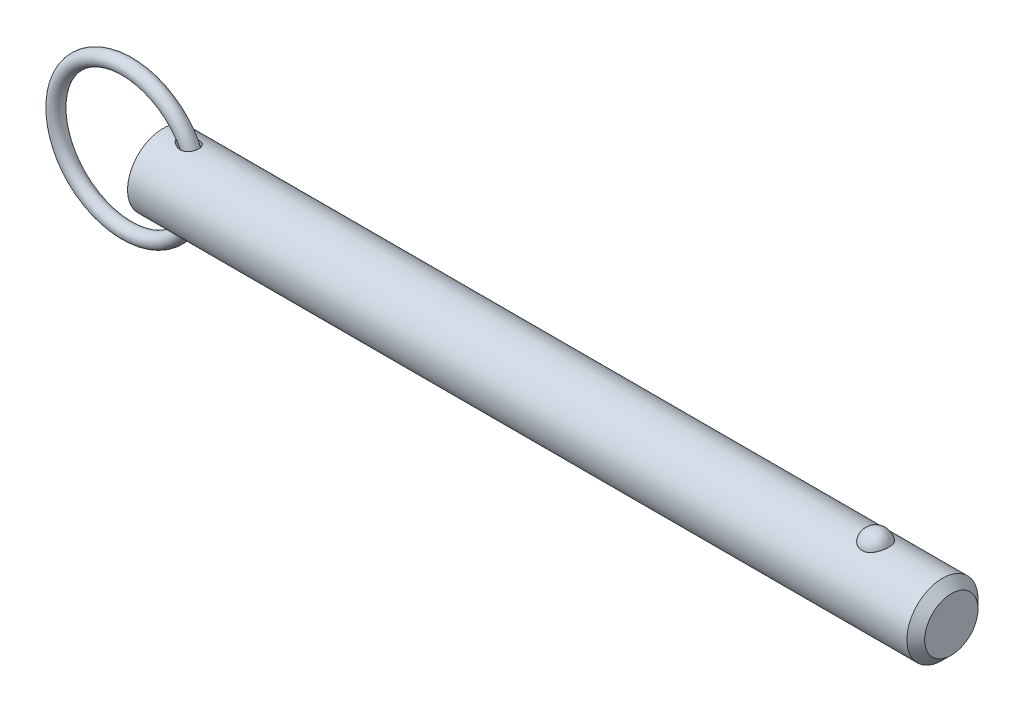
ISO-10303-21;
HEADER;
FILE_DESCRIPTION(('STEP AP214'),'2;1');
FILE_NAME('part.step','',(''),(''),'','','');
FILE_SCHEMA(('AUTOMOTIVE_DESIGN { 1 0 10303 214 1 1 1 1 }'));
ENDSEC;
DATA;
#1=APPLICATION_CONTEXT('core data for automotive mechanical design processes');
#2=APPLICATION_PROTOCOL_DEFINITION('international standard','automotive_design',2000,#1);
#3=PRODUCT_CONTEXT('',#1,'mechanical');
#4=PRODUCT('Part','Part','',(#3));
#5=PRODUCT_RELATED_PRODUCT_CATEGORY('part','',(#4));
#6=PRODUCT_DEFINITION_FORMATION('','',#4);
#7=PRODUCT_DEFINITION_CONTEXT('part definition',#1,'design');
#8=PRODUCT_DEFINITION('design','',#6,#7);
#9=PRODUCT_DEFINITION_SHAPE('','',#8);
#10=(LENGTH_UNIT() NAMED_UNIT(*) SI_UNIT(.MILLI.,.METRE.));
#11=(NAMED_UNIT(*) PLANE_ANGLE_UNIT() SI_UNIT($,.RADIAN.));
#12=(NAMED_UNIT(*) SI_UNIT($,.STERADIAN.) SOLID_ANGLE_UNIT());
#13=UNCERTAINTY_MEASURE_WITH_UNIT(LENGTH_MEASURE(1.E-05),#10,'distance_accuracy_value','');
#14=(GEOMETRIC_REPRESENTATION_CONTEXT(3) GLOBAL_UNCERTAINTY_ASSIGNED_CONTEXT((#13)) GLOBAL_UNIT_ASSIGNED_CONTEXT((#10,
#11,#12)) REPRESENTATION_CONTEXT('',''));
#15=CARTESIAN_POINT('',(0.,0.,0.));
#16=DIRECTION('',(0.,0.,1.));
#17=DIRECTION('',(1.,0.,0.));
#18=AXIS2_PLACEMENT_3D('',#15,#16,#17);
#19=CARTESIAN_POINT('',(-9.66825126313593,0.,0.));
#20=DIRECTION('',(0.,0.,1.));
#21=DIRECTION('',(1.,0.,0.));
#22=AXIS2_PLACEMENT_3D('',#19,#20,#21);
#23=TOROIDAL_SURFACE('',#22,19.05,1.905);
#24=CARTESIAN_POINT('',(11.2867487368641,0.,0.));
#25=VERTEX_POINT('',#24);
#26=VERTEX_LOOP('',#25);
#27=FACE_BOUND('',#26,.T.);
#28=ADVANCED_FACE('P0_F12',(#27),#23,.T.);
#29=CLOSED_SHELL('',(#28));
#30=MANIFOLD_SOLID_BREP('P0_B1',#29);
#31=CARTESIAN_POINT('',(0.,0.,0.));
#32=DIRECTION('',(1.,0.,0.));
#33=DIRECTION('',(0.,0.,-1.));
#34=AXIS2_PLACEMENT_3D('',#31,#32,#33);
#35=CYLINDRICAL_SURFACE('',#34,9.525);
#36=CARTESIAN_POINT('',(4.56693409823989,9.43141941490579,-1.33189820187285));
#37=CARTESIAN_POINT('',(4.70260475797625,9.41020313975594,-1.48215931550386));
#38=CARTESIAN_POINT('',(4.85555680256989,9.38755003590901,-1.61683982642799));
#39=CARTESIAN_POINT('',(5.10171959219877,9.35450554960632,-1.79512943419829));
#40=CARTESIAN_POINT('',(5.18674514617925,9.34362629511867,-1.85068909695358));
#41=CARTESIAN_POINT('',(5.3615438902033,9.32258514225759,-1.95392002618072));
#42=CARTESIAN_POINT('',(5.45131542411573,9.31242299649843,-2.00159402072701));
#43=CARTESIAN_POINT('',(5.70070211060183,9.28632120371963,-2.12033289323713));
#44=CARTESIAN_POINT('',(5.86420408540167,9.27146938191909,-2.18362944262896));
#45=CARTESIAN_POINT('',(6.19893345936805,9.24694163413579,-2.28525783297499));
#46=CARTESIAN_POINT('',(6.3701538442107,9.23726110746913,-2.32361187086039));
#47=CARTESIAN_POINT('',(6.73531776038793,9.22400982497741,-2.37575048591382));
#48=CARTESIAN_POINT('',(6.92975826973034,9.22118808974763,-2.38652934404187));
#49=CARTESIAN_POINT('',(7.21995443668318,9.22416297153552,-2.37494980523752));
#50=CARTESIAN_POINT('',(7.31643847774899,9.22635560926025,-2.366466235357));
#51=CARTESIAN_POINT('',(7.50796421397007,9.2331428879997,-2.33985028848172));
#52=CARTESIAN_POINT('',(7.6030065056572,9.23773650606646,-2.32172202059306));
#53=CARTESIAN_POINT('',(7.83273114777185,9.25183311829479,-2.26504721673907));
#54=CARTESIAN_POINT('',(7.96603028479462,9.26261470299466,-2.2209856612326));
#55=CARTESIAN_POINT('',(8.22310899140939,9.28816519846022,-2.1115730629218));
#56=CARTESIAN_POINT('',(8.34689477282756,9.30293147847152,-2.04623606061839));
#57=CARTESIAN_POINT('',(8.58136049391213,9.3349416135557,-1.89485344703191));
#58=CARTESIAN_POINT('',(8.69199721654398,9.35219324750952,-1.80874222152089));
#59=CARTESIAN_POINT('',(8.89592093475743,9.38707016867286,-1.61799188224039));
#60=CARTESIAN_POINT('',(8.98920771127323,9.40469546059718,-1.51335253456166));
#61=CARTESIAN_POINT('',(9.15057731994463,9.43713590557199,-1.29519427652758));
#62=CARTESIAN_POINT('',(9.21980158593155,9.45205440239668,-1.18253282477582));
#63=CARTESIAN_POINT('',(9.33826736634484,9.47856708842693,-0.946802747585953));
#64=CARTESIAN_POINT('',(9.38751161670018,9.49016173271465,-0.823735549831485));
#65=CARTESIAN_POINT('',(9.46423850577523,9.50859378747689,-0.57261402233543));
#66=CARTESIAN_POINT('',(9.49202393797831,9.5154972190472,-0.444656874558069));
#67=CARTESIAN_POINT('',(9.52636926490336,9.52406905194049,-0.185752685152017));
#68=CARTESIAN_POINT('',(9.53292923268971,9.52573747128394,-0.0548056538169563));
#69=CARTESIAN_POINT('',(9.52467276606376,9.52365852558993,0.20650329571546));
#70=CARTESIAN_POINT('',(9.50983454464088,9.51990564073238,0.336864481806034));
#71=CARTESIAN_POINT('',(9.45907362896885,9.50737852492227,0.593166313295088));
#72=CARTESIAN_POINT('',(9.42315106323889,9.49860432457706,0.719106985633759));
#73=CARTESIAN_POINT('',(9.3310664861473,9.4769892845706,0.96295935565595));
#74=CARTESIAN_POINT('',(9.27490839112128,9.46414923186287,1.08087260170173));
#75=CARTESIAN_POINT('',(9.14375803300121,9.43581000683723,1.30534632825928));
#76=CARTESIAN_POINT('',(9.06876720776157,9.42031103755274,1.41190767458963));
#77=CARTESIAN_POINT('',(8.90203187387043,9.38836719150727,1.61069439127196));
#78=CARTESIAN_POINT('',(8.81029913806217,9.37192298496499,1.70292975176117));
#79=CARTESIAN_POINT('',(8.6126877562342,9.33985045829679,1.87086859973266));
#80=CARTESIAN_POINT('',(8.50680947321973,9.3242221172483,1.94657251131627));
#81=CARTESIAN_POINT('',(8.28220546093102,9.29513431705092,2.08109032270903));
#82=CARTESIAN_POINT('',(8.16329919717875,9.28171415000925,2.13961034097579));
#83=CARTESIAN_POINT('',(7.91756052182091,9.25859072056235,2.23755716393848));
#84=CARTESIAN_POINT('',(7.79072606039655,9.24888842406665,2.27697900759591));
#85=CARTESIAN_POINT('',(7.52377913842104,9.23338749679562,2.33907806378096));
#86=CARTESIAN_POINT('',(7.3833476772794,9.22789571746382,2.36044900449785));
#87=CARTESIAN_POINT('',(7.1008139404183,9.22210229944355,2.3829751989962));
#88=CARTESIAN_POINT('',(6.95871103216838,9.22180269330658,2.38412253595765));
#89=CARTESIAN_POINT('',(6.65642691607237,9.22632724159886,2.36656230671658));
#90=CARTESIAN_POINT('',(6.49641694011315,9.23185415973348,2.3451317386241));
#91=CARTESIAN_POINT('',(6.18115433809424,9.24811737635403,2.28014143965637));
#92=CARTESIAN_POINT('',(6.02590710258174,9.25885936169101,2.23655754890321));
#93=CARTESIAN_POINT('',(5.69904720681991,9.28624254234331,2.12025087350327));
#94=CARTESIAN_POINT('',(5.52873601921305,9.30354853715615,2.04400672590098));
#95=CARTESIAN_POINT('',(5.20289495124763,9.34106989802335,1.86504730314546));
#96=CARTESIAN_POINT('',(5.0473596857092,9.36128419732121,1.76234172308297));
#97=CARTESIAN_POINT('',(4.79287124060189,9.39697639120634,1.55895334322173));
#98=CARTESIAN_POINT('',(4.6893870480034,9.41240250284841,1.46392900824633));
#99=CARTESIAN_POINT('',(4.4984714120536,9.44202586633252,1.25875918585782));
#100=CARTESIAN_POINT('',(4.41101129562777,9.45622528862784,1.1486413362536));
#101=CARTESIAN_POINT('',(4.27502257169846,9.47888210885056,0.940600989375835));
#102=CARTESIAN_POINT('',(4.22216329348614,9.48791121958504,0.845586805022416));
#103=CARTESIAN_POINT('',(4.13241478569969,9.50344321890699,0.648051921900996));
#104=CARTESIAN_POINT('',(4.0955118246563,9.50994827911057,0.545537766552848));
#105=CARTESIAN_POINT('',(4.04043124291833,9.51971586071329,0.334452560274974));
#106=CARTESIAN_POINT('',(4.02240728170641,9.52295176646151,0.225839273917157));
#107=CARTESIAN_POINT('',(4.00750873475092,9.52562364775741,0.00713006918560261));
#108=CARTESIAN_POINT('',(4.01062334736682,9.52506156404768,-0.102965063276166));
#109=CARTESIAN_POINT('',(4.03592967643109,9.52053221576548,-0.306944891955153));
#110=CARTESIAN_POINT('',(4.05571676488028,9.51699426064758,-0.401151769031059));
#111=CARTESIAN_POINT('',(4.10967975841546,9.5074546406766,-0.585176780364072));
#112=CARTESIAN_POINT('',(4.1438599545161,9.50145224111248,-0.674993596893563));
#113=CARTESIAN_POINT('',(4.23261356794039,9.48611703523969,-0.866116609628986));
#114=CARTESIAN_POINT('',(4.28990016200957,9.47635800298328,-0.966121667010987));
#115=CARTESIAN_POINT('',(4.4185657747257,9.45502867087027,-1.15640011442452));
#116=CARTESIAN_POINT('',(4.4899691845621,9.44345524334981,-1.24665623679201));
#117=CARTESIAN_POINT('',(4.56693409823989,9.43141941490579,-1.33189820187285));
#118=B_SPLINE_CURVE_WITH_KNOTS('',3,(#36,#37,#38,#39,#40,#41,#42,#43,#44,#45,#46,#47,#48,#49,
#50,#51,#52,#53,#54,#55,#56,#57,#58,#59,#60,#61,#62,#63,#64,#65,#66,#67,#68,#69,#70,#71,#72,#73,
#74,#75,#76,#77,#78,#79,#80,#81,#82,#83,#84,#85,#86,#87,#88,#89,#90,#91,#92,#93,#94,#95,#96,#97,
#98,#99,#100,#101,#102,#103,#104,#105,#106,#107,#108,#109,#110,#111,#112,#113,#114,#115,#116,
#117),.UNSPECIFIED.,.T.,.F.,(4,2,2,2,2,2,2,2,2,2,2,2,2,2,2,2,2,2,2,2,2,2,2,2,2,2,2,2,2,2,2,2,2,
2,2,2,2,2,2,2,4),(0.,0.609951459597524,0.916123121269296,1.22218863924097,1.74791337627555,
2.27316961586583,2.85362722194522,3.14383229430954,3.43391382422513,3.85437497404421,
4.27455920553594,4.69608835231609,5.11762282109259,5.5149005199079,5.91212379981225,
6.30363414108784,6.69514313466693,7.08705103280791,7.47895654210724,7.87078624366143,
8.26258603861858,8.65411137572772,9.04562666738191,9.44349251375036,9.84146165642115,
10.2662286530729,10.6911619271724,11.1739180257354,11.6572017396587,12.2170157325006,
12.7766249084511,13.1992556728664,13.6211226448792,13.9471990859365,14.2729943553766,
14.6014211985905,14.9296802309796,15.2173810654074,15.505167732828,15.8505863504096,
16.1966070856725),.UNSPECIFIED.);
#119=CARTESIAN_POINT('',(4.56693409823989,9.43141941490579,-1.33189820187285));
#120=VERTEX_POINT('',#119);
#121=EDGE_CURVE('P1_E40',#120,#120,#118,.T.);
#122=ORIENTED_EDGE('',*,*,#121,.T.);
#123=EDGE_LOOP('',(#122));
#124=FACE_BOUND('',#123,.T.);
#125=CARTESIAN_POINT('',(208.74875,0.,0.));
#126=DIRECTION('',(1.,0.,0.));
#127=DIRECTION('',(0.,0.,-1.));
#128=AXIS2_PLACEMENT_3D('',#125,#126,#127);
#129=CIRCLE('',#128,9.525);
#130=CARTESIAN_POINT('',(208.74875,0.,-9.525));
#131=VERTEX_POINT('',#130);
#132=EDGE_CURVE('P1_E25',#131,#131,#129,.T.);
#133=ORIENTED_EDGE('',*,*,#132,.F.);
#134=EDGE_LOOP('',(#133));
#135=FACE_BOUND('',#134,.T.);
#136=CARTESIAN_POINT('',(0.,0.,0.));
#137=DIRECTION('',(1.,0.,0.));
#138=DIRECTION('',(0.,0.,-1.));
#139=AXIS2_PLACEMENT_3D('',#136,#137,#138);
#140=CIRCLE('',#139,9.525);
#141=CARTESIAN_POINT('',(0.,0.,-9.525));
#142=VERTEX_POINT('',#141);
#143=EDGE_CURVE('P1_E9',#142,#142,#140,.T.);
#144=ORIENTED_EDGE('',*,*,#143,.T.);
#145=EDGE_LOOP('',(#144));
#146=FACE_BOUND('',#145,.T.);
#147=CARTESIAN_POINT('',(190.845757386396,8.80405803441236,3.63513233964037));
#148=CARTESIAN_POINT('',(190.751676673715,8.80405953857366,3.63513053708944));
#149=CARTESIAN_POINT('',(190.657561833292,8.80561325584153,3.63137461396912));
#150=CARTESIAN_POINT('',(190.470012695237,8.81177748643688,3.616386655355));
#151=CARTESIAN_POINT('',(190.376578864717,8.81638992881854,3.60514990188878));
#152=CARTESIAN_POINT('',(190.097945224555,8.83467114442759,3.56024627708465));
#153=CARTESIAN_POINT('',(189.914691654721,8.85278327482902,3.51538626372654));
#154=CARTESIAN_POINT('',(189.559509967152,8.89871214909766,3.39742145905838));
#155=CARTESIAN_POINT('',(189.387553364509,8.9265032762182,3.32439116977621));
#156=CARTESIAN_POINT('',(189.058707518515,8.98874819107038,3.15220244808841));
#157=CARTESIAN_POINT('',(188.901811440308,9.02319893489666,3.053055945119));
#158=CARTESIAN_POINT('',(188.602214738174,9.0962918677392,2.82797815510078));
#159=CARTESIAN_POINT('',(188.460060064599,9.13502685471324,2.70135138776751));
#160=CARTESIAN_POINT('',(188.198299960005,9.21186572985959,2.42641932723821));
#161=CARTESIAN_POINT('',(188.078701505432,9.2499694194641,2.27810735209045));
#162=CARTESIAN_POINT('',(187.859645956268,9.3234108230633,1.95652290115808));
#163=CARTESIAN_POINT('',(187.761317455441,9.35855090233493,1.78243511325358));
#164=CARTESIAN_POINT('',(187.593819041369,9.42045142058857,1.41937246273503));
#165=CARTESIAN_POINT('',(187.524651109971,9.44721128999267,1.23039658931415));
#166=CARTESIAN_POINT('',(187.416199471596,9.48990641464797,0.840370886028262));
#167=CARTESIAN_POINT('',(187.377288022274,9.50570658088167,0.639202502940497));
#168=CARTESIAN_POINT('',(187.331555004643,9.52433146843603,0.232664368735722));
#169=CARTESIAN_POINT('',(187.324732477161,9.52715657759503,0.0272947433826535));
#170=CARTESIAN_POINT('',(187.343255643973,9.51956918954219,-0.380478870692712));
#171=CARTESIAN_POINT('',(187.368405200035,9.50923740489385,-0.582893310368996));
#172=CARTESIAN_POINT('',(187.45002537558,9.47651897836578,-0.980293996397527));
#173=CARTESIAN_POINT('',(187.506496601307,9.45413210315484,-1.17528009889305));
#174=CARTESIAN_POINT('',(187.649719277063,9.39954044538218,-1.55263697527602));
#175=CARTESIAN_POINT('',(187.736512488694,9.36732213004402,-1.73498993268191));
#176=CARTESIAN_POINT('',(187.938610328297,9.29640700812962,-2.08177763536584));
#177=CARTESIAN_POINT('',(188.053917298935,9.25770966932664,-2.24621090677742));
#178=CARTESIAN_POINT('',(188.311264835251,9.17775604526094,-2.55338333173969));
#179=CARTESIAN_POINT('',(188.453434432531,9.136488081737,-2.69601150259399));
#180=CARTESIAN_POINT('',(188.76089985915,9.05620497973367,-2.95451229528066));
#181=CARTESIAN_POINT('',(188.926193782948,9.01718965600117,-3.07038711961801));
#182=CARTESIAN_POINT('',(189.272052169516,8.9468001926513,-3.26976836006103));
#183=CARTESIAN_POINT('',(189.452227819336,8.91528408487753,-3.35389750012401));
#184=CARTESIAN_POINT('',(189.825651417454,8.86272514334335,-3.49043503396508));
#185=CARTESIAN_POINT('',(190.018894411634,8.8416783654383,-3.54285537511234));
#186=CARTESIAN_POINT('',(190.402503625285,8.81348056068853,-3.61241306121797));
#187=CARTESIAN_POINT('',(190.592525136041,8.80568348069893,-3.63119339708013));
#188=CARTESIAN_POINT('',(190.973190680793,8.80289410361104,-3.6379534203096));
#189=CARTESIAN_POINT('',(191.163834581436,8.8078992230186,-3.6259393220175));
#190=CARTESIAN_POINT('',(191.534007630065,8.82974915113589,-3.57238430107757));
#191=CARTESIAN_POINT('',(191.713697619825,8.84621463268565,-3.53178890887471));
#192=CARTESIAN_POINT('',(192.063422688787,8.88875330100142,-3.42331083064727));
#193=CARTESIAN_POINT('',(192.233456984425,8.91482726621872,-3.35542593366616));
#194=CARTESIAN_POINT('',(192.563237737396,8.97448239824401,-3.19248225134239));
#195=CARTESIAN_POINT('',(192.722680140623,9.00821446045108,-3.09686474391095));
#196=CARTESIAN_POINT('',(193.023513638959,9.0793539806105,-2.88162736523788));
#197=CARTESIAN_POINT('',(193.164900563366,9.1167622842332,-2.7620019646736));
#198=CARTESIAN_POINT('',(193.43331931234,9.19347419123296,-2.49516285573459));
#199=CARTESIAN_POINT('',(193.559275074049,9.23277872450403,-2.3468661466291));
#200=CARTESIAN_POINT('',(193.785522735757,9.30737610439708,-2.03093683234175));
#201=CARTESIAN_POINT('',(193.88581004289,9.34266823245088,-1.86330077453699));
#202=CARTESIAN_POINT('',(194.061514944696,9.40674710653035,-1.50744893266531));
#203=CARTESIAN_POINT('',(194.136041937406,9.4352917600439,-1.31874876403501));
#204=CARTESIAN_POINT('',(194.25416505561,9.4814413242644,-0.930631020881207));
#205=CARTESIAN_POINT('',(194.297760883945,9.49904612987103,-0.731213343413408));
#206=CARTESIAN_POINT('',(194.353158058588,9.5215314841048,-0.327147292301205));
#207=CARTESIAN_POINT('',(194.364935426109,9.52640243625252,-0.122495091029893));
#208=CARTESIAN_POINT('',(194.356382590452,9.52289571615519,0.286018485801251));
#209=CARTESIAN_POINT('',(194.33605305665,9.51451832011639,0.48987987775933));
#210=CARTESIAN_POINT('',(194.263884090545,9.48544083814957,0.889994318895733));
#211=CARTESIAN_POINT('',(194.212199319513,9.46480124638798,1.08627971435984));
#212=CARTESIAN_POINT('',(194.078491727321,9.4133389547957,1.46682086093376));
#213=CARTESIAN_POINT('',(193.996466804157,9.38251554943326,1.65107577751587));
#214=CARTESIAN_POINT('',(193.80319292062,9.31365636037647,2.00346348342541));
#215=CARTESIAN_POINT('',(193.691783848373,9.27558138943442,2.17150083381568));
#216=CARTESIAN_POINT('',(193.442294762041,9.19638714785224,2.48563115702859));
#217=CARTESIAN_POINT('',(193.304216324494,9.15526805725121,2.63172542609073));
#218=CARTESIAN_POINT('',(193.004843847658,9.07465393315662,2.89750997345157));
#219=CARTESIAN_POINT('',(192.843610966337,9.03515496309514,3.01726776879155));
#220=CARTESIAN_POINT('',(192.501613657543,8.96227564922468,3.22732920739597));
#221=CARTESIAN_POINT('',(192.320841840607,8.92889763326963,3.31762165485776));
#222=CARTESIAN_POINT('',(191.951445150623,8.87345380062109,3.46314419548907));
#223=CARTESIAN_POINT('',(191.76332371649,8.85102983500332,3.51950082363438));
#224=CARTESIAN_POINT('',(191.47578699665,8.82666967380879,3.57993683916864));
#225=CARTESIAN_POINT('',(191.379133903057,8.82009725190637,3.59606217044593));
#226=CARTESIAN_POINT('',(191.184677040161,8.81020897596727,3.62022512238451));
#227=CARTESIAN_POINT('',(191.08687410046,8.80689090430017,3.62826825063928));
#228=CARTESIAN_POINT('',(190.941224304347,8.80445615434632,3.63416760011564));
#229=CARTESIAN_POINT('',(190.893495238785,8.80405727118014,3.63513325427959));
#230=CARTESIAN_POINT('',(190.845757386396,8.80405803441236,3.63513233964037));
#231=B_SPLINE_CURVE_WITH_KNOTS('',3,(#147,#148,#149,#150,#151,#152,#153,#154,#155,#156,#157,
#158,#159,#160,#161,#162,#163,#164,#165,#166,#167,#168,#169,#170,#171,#172,#173,#174,#175,#176,
#177,#178,#179,#180,#181,#182,#183,#184,#185,#186,#187,#188,#189,#190,#191,#192,#193,#194,#195,
#196,#197,#198,#199,#200,#201,#202,#203,#204,#205,#206,#207,#208,#209,#210,#211,#212,#213,#214,
#215,#216,#217,#218,#219,#220,#221,#222,#223,#224,#225,#226,#227,#228,#229,#230),.UNSPECIFIED.,
.T.,.F.,(4,2,2,2,2,2,2,2,2,2,2,2,2,2,2,2,2,2,2,2,2,2,2,2,2,2,2,2,2,2,2,2,2,2,2,2,2,2,2,2,2,4),
(0.,0.282202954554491,0.564584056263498,1.13017050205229,1.69427128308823,2.25811483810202,
2.83836627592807,3.41879688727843,4.02497117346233,4.63118665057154,5.24474754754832,
5.85829010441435,6.46808687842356,7.07789545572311,7.68854723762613,8.29924920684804,
8.91296283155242,9.52662591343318,10.1275338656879,10.7282152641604,11.2986646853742,
11.868998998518,12.4213015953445,12.9736489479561,13.5380053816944,14.1024919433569,
14.695298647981,15.2882113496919,15.8999469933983,16.5116885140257,17.1238909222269,
17.7360805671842,18.3452748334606,18.9545113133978,19.5671386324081,20.1797297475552,
20.7907316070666,21.4019653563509,21.9915938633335,22.2859053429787,22.580016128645,
22.7232098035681),.UNSPECIFIED.);
#232=CARTESIAN_POINT('',(190.845757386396,8.80405803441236,3.63513233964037));
#233=VERTEX_POINT('',#232);
#234=EDGE_CURVE('P1_E34',#233,#233,#231,.T.);
#235=ORIENTED_EDGE('',*,*,#234,.T.);
#236=EDGE_LOOP('',(#235));
#237=FACE_BOUND('',#236,.T.);
#238=CARTESIAN_POINT('',(4.56693409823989,-9.43141941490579,-1.33189820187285));
#239=CARTESIAN_POINT('',(4.48932984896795,-9.4435553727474,-1.24594548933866));
#240=CARTESIAN_POINT('',(4.41737309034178,-9.45522193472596,-1.1548795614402));
#241=CARTESIAN_POINT('',(4.28781047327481,-9.47670896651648,-0.962782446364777));
#242=CARTESIAN_POINT('',(4.23019403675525,-9.48653079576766,-0.861758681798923));
#243=CARTESIAN_POINT('',(4.132545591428,-9.5034118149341,-0.649723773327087));
#244=CARTESIAN_POINT('',(4.09271158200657,-9.51043980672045,-0.538615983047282));
#245=CARTESIAN_POINT('',(4.04973167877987,-9.51806966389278,-0.367764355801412));
#246=CARTESIAN_POINT('',(4.03820037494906,-9.52012756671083,-0.310118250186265));
#247=CARTESIAN_POINT('',(4.02100287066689,-9.52320274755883,-0.193935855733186));
#248=CARTESIAN_POINT('',(4.01533565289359,-9.52422020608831,-0.135399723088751));
#249=CARTESIAN_POINT('',(4.0081707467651,-9.52550497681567,0.0247266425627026));
#250=CARTESIAN_POINT('',(4.0127049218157,-9.52468821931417,0.126661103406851));
#251=CARTESIAN_POINT('',(4.03954973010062,-9.51988506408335,0.328012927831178));
#252=CARTESIAN_POINT('',(4.06186450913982,-9.51589792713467,0.42742969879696));
#253=CARTESIAN_POINT('',(4.12088980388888,-9.5054852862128,0.616362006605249));
#254=CARTESIAN_POINT('',(4.15684838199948,-9.49918763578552,0.706123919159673));
#255=CARTESIAN_POINT('',(4.24094647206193,-9.48470618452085,0.879522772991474));
#256=CARTESIAN_POINT('',(4.28909090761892,-9.47652162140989,0.96315722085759));
#257=CARTESIAN_POINT('',(4.42295891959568,-9.45426317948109,1.16513741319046));
#258=CARTESIAN_POINT('',(4.51523752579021,-9.43933320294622,1.27905352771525));
#259=CARTESIAN_POINT('',(4.71682295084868,-9.40825940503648,1.49055892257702));
#260=CARTESIAN_POINT('',(4.82617286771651,-9.39211256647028,1.58810554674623));
#261=CARTESIAN_POINT('',(5.09064226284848,-9.35555264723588,1.79246125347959));
#262=CARTESIAN_POINT('',(5.2499041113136,-9.33524115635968,1.89393122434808));
#263=CARTESIAN_POINT('',(5.58309255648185,-9.29785396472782,2.06968659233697));
#264=CARTESIAN_POINT('',(5.75702897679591,-9.28078045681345,2.14395359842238));
#265=CARTESIAN_POINT('',(6.11646882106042,-9.25213303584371,2.26440412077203));
#266=CARTESIAN_POINT('',(6.30205582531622,-9.2406056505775,2.31035092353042));
#267=CARTESIAN_POINT('',(6.67856093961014,-9.22541807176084,2.37029728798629));
#268=CARTESIAN_POINT('',(6.8694704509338,-9.2217458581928,2.3843456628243));
#269=CARTESIAN_POINT('',(7.21217144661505,-9.22344239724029,2.37775005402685));
#270=CARTESIAN_POINT('',(7.36409439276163,-9.22713860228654,2.36352577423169));
#271=CARTESIAN_POINT('',(7.66346227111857,-9.24048072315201,2.31082299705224));
#272=CARTESIAN_POINT('',(7.81090958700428,-9.25012341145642,2.27235765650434));
#273=CARTESIAN_POINT('',(8.09730316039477,-9.2746609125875,2.17003648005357));
#274=CARTESIAN_POINT('',(8.2361965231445,-9.28958517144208,2.10603803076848));
#275=CARTESIAN_POINT('',(8.49918675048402,-9.32290326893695,1.95324442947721));
#276=CARTESIAN_POINT('',(8.62328895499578,-9.34129584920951,1.86445826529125));
#277=CARTESIAN_POINT('',(8.84006515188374,-9.37706953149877,1.67466761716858));
#278=CARTESIAN_POINT('',(8.93465172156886,-9.39436331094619,1.57582357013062));
#279=CARTESIAN_POINT('',(9.10490234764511,-9.42761680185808,1.362809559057));
#280=CARTESIAN_POINT('',(9.18057146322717,-9.44357686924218,1.24864370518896));
#281=CARTESIAN_POINT('',(9.30789178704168,-9.47159985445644,1.01379272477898));
#282=CARTESIAN_POINT('',(9.36045544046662,-9.48380365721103,0.893617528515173));
#283=CARTESIAN_POINT('',(9.44498362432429,-9.50388751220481,0.645890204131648));
#284=CARTESIAN_POINT('',(9.47694947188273,-9.51176784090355,0.518338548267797));
#285=CARTESIAN_POINT('',(9.51944262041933,-9.52232073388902,0.260103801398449));
#286=CARTESIAN_POINT('',(9.53006646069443,-9.52501674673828,0.129437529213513));
#287=CARTESIAN_POINT('',(9.52993291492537,-9.52498309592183,-0.131885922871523));
#288=CARTESIAN_POINT('',(9.51917525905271,-9.52225336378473,-0.26254310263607));
#289=CARTESIAN_POINT('',(9.47648788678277,-9.51165418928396,-0.520312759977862));
#290=CARTESIAN_POINT('',(9.44453086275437,-9.50377811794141,-0.647420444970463));
#291=CARTESIAN_POINT('',(9.36015568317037,-9.48373425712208,-0.89429087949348));
#292=CARTESIAN_POINT('',(9.30773827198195,-9.47156662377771,-1.01405389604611));
#293=CARTESIAN_POINT('',(9.1838089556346,-9.44428888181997,-1.24269386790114));
#294=CARTESIAN_POINT('',(9.11232064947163,-9.42918241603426,-1.3515840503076));
#295=CARTESIAN_POINT('',(8.9521268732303,-9.39767706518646,-1.55562459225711));
#296=CARTESIAN_POINT('',(8.86342281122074,-9.3812782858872,-1.65077607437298));
#297=CARTESIAN_POINT('',(8.6710444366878,-9.34891827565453,-1.82517515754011));
#298=CARTESIAN_POINT('',(8.56732858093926,-9.33295841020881,-1.90437711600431));
#299=CARTESIAN_POINT('',(8.34818438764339,-9.30317889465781,-2.0449122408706));
#300=CARTESIAN_POINT('',(8.23275529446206,-9.28935938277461,-2.10624425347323));
#301=CARTESIAN_POINT('',(7.98961240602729,-9.26475003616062,-2.2120340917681));
#302=CARTESIAN_POINT('',(7.86162088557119,-9.25407358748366,-2.25587700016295));
#303=CARTESIAN_POINT('',(7.60027499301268,-9.23720810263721,-2.32397032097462));
#304=CARTESIAN_POINT('',(7.46691858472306,-9.23102078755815,-2.34821321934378));
#305=CARTESIAN_POINT('',(7.18516230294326,-9.22302718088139,-2.37943079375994));
#306=CARTESIAN_POINT('',(7.03654454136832,-9.22169704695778,-2.38452997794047));
#307=CARTESIAN_POINT('',(6.74015049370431,-9.22442327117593,-2.37395141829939));
#308=CARTESIAN_POINT('',(6.59237455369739,-9.22848170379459,-2.35826567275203));
#309=CARTESIAN_POINT('',(6.27762777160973,-9.2422287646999,-2.30385559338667));
#310=CARTESIAN_POINT('',(6.11124715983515,-9.25269504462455,-2.26192683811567));
#311=CARTESIAN_POINT('',(5.78635920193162,-9.27830776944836,-2.15445569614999));
#312=CARTESIAN_POINT('',(5.62786567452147,-9.29346211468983,-2.08887341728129));
#313=CARTESIAN_POINT('',(5.39013065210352,-9.31931237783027,-1.96924953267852));
#314=CARTESIAN_POINT('',(5.30683088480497,-9.32901725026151,-1.92292485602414));
#315=CARTESIAN_POINT('',(5.1445580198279,-9.34899035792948,-1.82334419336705));
#316=CARTESIAN_POINT('',(5.06558607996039,-9.35925874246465,-1.77008636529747));
#317=CARTESIAN_POINT('',(4.83670950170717,-9.39034445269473,-1.60010986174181));
#318=CARTESIAN_POINT('',(4.69422471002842,-9.41151337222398,-1.47288240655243));
#319=CARTESIAN_POINT('',(4.56693409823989,-9.43141941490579,-1.33189820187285));
#320=B_SPLINE_CURVE_WITH_KNOTS('',3,(#238,#239,#240,#241,#242,#243,#244,#245,#246,#247,#248,
#249,#250,#251,#252,#253,#254,#255,#256,#257,#258,#259,#260,#261,#262,#263,#264,#265,#266,#267,
#268,#269,#270,#271,#272,#273,#274,#275,#276,#277,#278,#279,#280,#281,#282,#283,#284,#285,#286,
#287,#288,#289,#290,#291,#292,#293,#294,#295,#296,#297,#298,#299,#300,#301,#302,#303,#304,#305,
#306,#307,#308,#309,#310,#311,#312,#313,#314,#315,#316,#317,#318,#319),.UNSPECIFIED.,.T.,.F.,(4,
2,2,2,2,2,2,2,2,2,2,2,2,2,2,2,2,2,2,2,2,2,2,2,2,2,2,2,2,2,2,2,2,2,2,2,2,2,2,2,4),(0.,
0.348900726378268,0.697543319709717,1.0499765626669,1.22617690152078,1.40234666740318,
1.70666745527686,2.01105922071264,2.30066493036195,2.59038784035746,3.03001384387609,
3.4707682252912,4.03766594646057,4.60494622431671,5.17690598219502,5.74798989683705,
6.20400848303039,6.65977977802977,7.11813321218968,7.57632066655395,7.98791759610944,
8.39940433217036,8.7927345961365,9.18603970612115,9.577561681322,9.9690885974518,
10.3611208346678,10.7531388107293,11.1446739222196,11.536177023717,11.9287850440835,
12.3214184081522,12.7268448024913,13.1324265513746,13.5768390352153,14.0214226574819,
14.5351685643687,15.0497849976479,15.3368801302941,15.6240516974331,16.1963372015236),.UNSPECIFIED.);
#321=CARTESIAN_POINT('',(4.56693409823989,-9.43141941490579,-1.33189820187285));
#322=VERTEX_POINT('',#321);
#323=EDGE_CURVE('P1_E17',#322,#322,#320,.T.);
#324=ORIENTED_EDGE('',*,*,#323,.T.);
#325=EDGE_LOOP('',(#324));
#326=FACE_BOUND('',#325,.T.);
#327=ADVANCED_FACE('P1_F13',(#124,#135,#146,#237,#326),#35,.T.);
#328=CARTESIAN_POINT('',(0.,0.,0.));
#329=DIRECTION('',(-1.,0.,0.));
#330=DIRECTION('',(0.,0.,1.));
#331=AXIS2_PLACEMENT_3D('',#328,#329,#330);
#332=PLANE('',#331);
#333=ORIENTED_EDGE('',*,*,#143,.F.);
#334=EDGE_LOOP('',(#333));
#335=FACE_BOUND('',#334,.T.);
#336=ADVANCED_FACE('P1_F15',(#335),#332,.T.);
#337=CARTESIAN_POINT('',(211.13,0.,0.));
#338=DIRECTION('',(-1.,0.,0.));
#339=DIRECTION('',(0.,0.,1.));
#340=AXIS2_PLACEMENT_3D('',#337,#338,#339);
#341=CONICAL_SURFACE('',#340,7.14375000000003,0.785398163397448);
#342=ORIENTED_EDGE('',*,*,#132,.T.);
#343=EDGE_LOOP('',(#342));
#344=FACE_BOUND('',#343,.T.);
#345=CARTESIAN_POINT('',(211.13,0.,0.));
#346=DIRECTION('',(1.,0.,0.));
#347=DIRECTION('',(0.,0.,-1.));
#348=AXIS2_PLACEMENT_3D('',#345,#346,#347);
#349=CIRCLE('',#348,7.14375000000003);
#350=CARTESIAN_POINT('',(211.13,0.,-7.14375000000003));
#351=VERTEX_POINT('',#350);
#352=EDGE_CURVE('P1_E30',#351,#351,#349,.T.);
#353=ORIENTED_EDGE('',*,*,#352,.F.);
#354=EDGE_LOOP('',(#353));
#355=FACE_BOUND('',#354,.T.);
#356=ADVANCED_FACE('P1_F55',(#344,#355),#341,.T.);
#357=CARTESIAN_POINT('',(211.13,7.14375000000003,0.));
#358=DIRECTION('',(1.,0.,0.));
#359=DIRECTION('',(0.,0.,-1.));
#360=AXIS2_PLACEMENT_3D('',#357,#358,#359);
#361=PLANE('',#360);
#362=ORIENTED_EDGE('',*,*,#352,.T.);
#363=EDGE_LOOP('',(#362));
#364=FACE_BOUND('',#363,.T.);
#365=ADVANCED_FACE('P1_F51',(#364),#361,.T.);
#366=CARTESIAN_POINT('',(190.845757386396,8.57249999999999,0.));
#367=DIRECTION('',(-1.,0.,0.));
#368=DIRECTION('',(0.,1.,0.));
#369=AXIS2_PLACEMENT_3D('',#366,#367,#368);
#370=SPHERICAL_SURFACE('',#369,3.64250000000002);
#371=ORIENTED_EDGE('',*,*,#234,.F.);
#372=EDGE_LOOP('',(#371));
#373=FACE_BOUND('',#372,.T.);
#374=ADVANCED_FACE('P1_F46',(#373),#370,.T.);
#375=CARTESIAN_POINT('',(-9.66825126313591,0.,0.));
#376=DIRECTION('',(0.,0.,1.));
#377=DIRECTION('',(1.,0.,0.));
#378=AXIS2_PLACEMENT_3D('',#375,#376,#377);
#379=TOROIDAL_SURFACE('',#378,19.05,2.38125);
#380=ORIENTED_EDGE('',*,*,#323,.F.);
#381=EDGE_LOOP('',(#380));
#382=FACE_BOUND('',#381,.T.);
#383=ORIENTED_EDGE('',*,*,#121,.F.);
#384=EDGE_LOOP('',(#383));
#385=FACE_BOUND('',#384,.T.);
#386=ADVANCED_FACE('P1_F50',(#382,#385),#379,.F.);
#387=CLOSED_SHELL('',(#327,#336,#356,#365,#374,#386));
#388=MANIFOLD_SOLID_BREP('P1_B1',#387);
#389=ADVANCED_BREP_SHAPE_REPRESENTATION('',(#18,#30,#388),#14);
#390=SHAPE_DEFINITION_REPRESENTATION(#9,#389);
ENDSEC;
END-ISO-10303-21;
